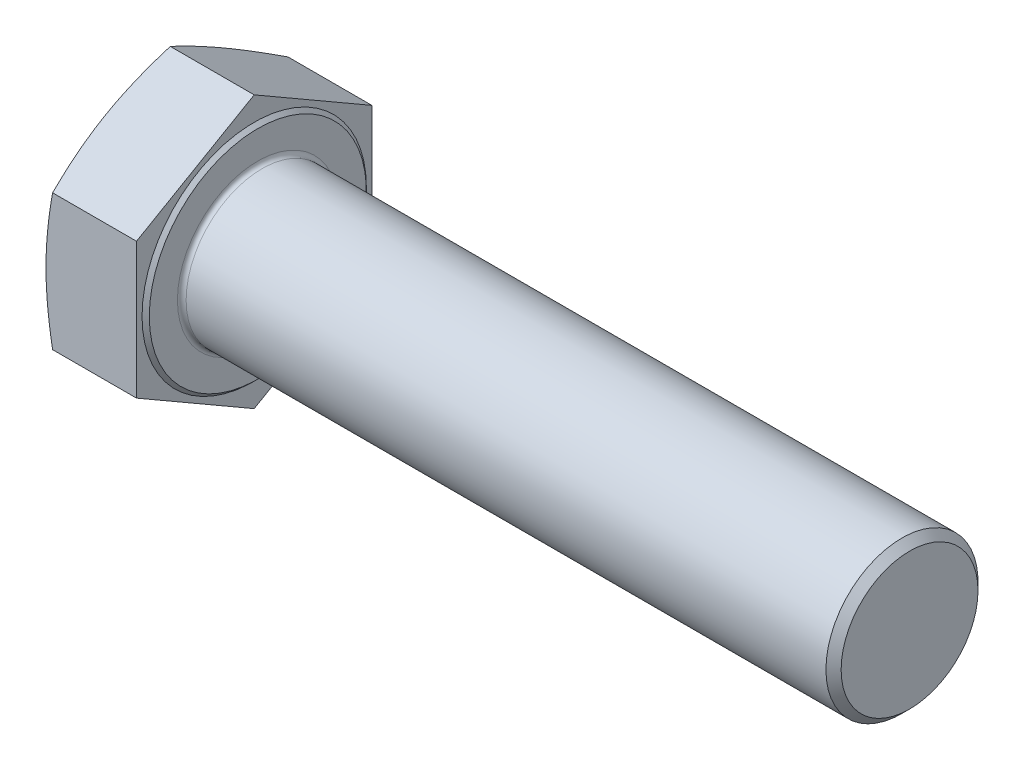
from build123d import *

# Parameters (mm, degrees)
BASEHEAD_DEPTH = 26
SKETCH5_R      = 21
BASEBODY_DEPTH = 180
CHAMFER1_SIZE  = 2.1
HEADFILLET_R   = 1.2


with BuildPart() as part:
    # Sketch2 → BaseHead (new body)
    with BuildSketch(Plane(origin=(0, 0, 0), x_dir=(0, 0, -1), z_dir=(1, 0, 0))):
        Polygon((0, -37.527767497), (32.5, -18.763883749), (32.5, 18.763883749), (0, 37.527767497), (-32.5, 18.763883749), (-32.5, -18.763883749), align=None)
    extrude(amount=BASEHEAD_DEPTH)

    # Sketch3 → BearingFace (revolve, cut)
    with BuildSketch(Plane.XY, mode=Mode.PRIVATE) as bearingface_sk:
        Polygon((26, 37.527767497), (26, 29.975), (25, 30.975), (25, 37.527767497), align=None)
    revolve(bearingface_sk.sketch.rotate(Axis((-0.957090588, 0, 0), (1, 0, 0)), 90), axis=Axis((-0.957090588, 0, 0), (1, 0, 0)), mode=Mode.SUBTRACT)

    # Sketch4 → HeadChamfer (revolve, cut)
    with BuildSketch(Plane.XY):
        Polygon((0, 37.527767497), (1.829957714, 37.527767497), (0, 32.5), align=None)
    revolve(axis=Axis((-0.493528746, 0, 0), (1, 0, 0)), mode=Mode.SUBTRACT)

    # Sketch5 → BaseBody (add)
    with BuildSketch(Plane(origin=(26, 0, 0), x_dir=(0, 0, -1), z_dir=(1, 0, 0))):
        with Locations(Location((0, 0, 0), (0, 0, 180))):
            Circle(SKETCH5_R)
    extrude(amount=BASEBODY_DEPTH)

    # Chamfer1
    chamfer1_edges = [part.edges().sort_by_distance(p)[0] for p in [
        (206, 0, -21),
    ]]
    chamfer(chamfer1_edges, length=CHAMFER1_SIZE)

    # HeadFillet
    headfillet_edges = [part.edges().sort_by_distance(p)[0] for p in [
        (26, 0, -21),
    ]]
    fillet(headfillet_edges, radius=HEADFILLET_R)


solid = part.part
